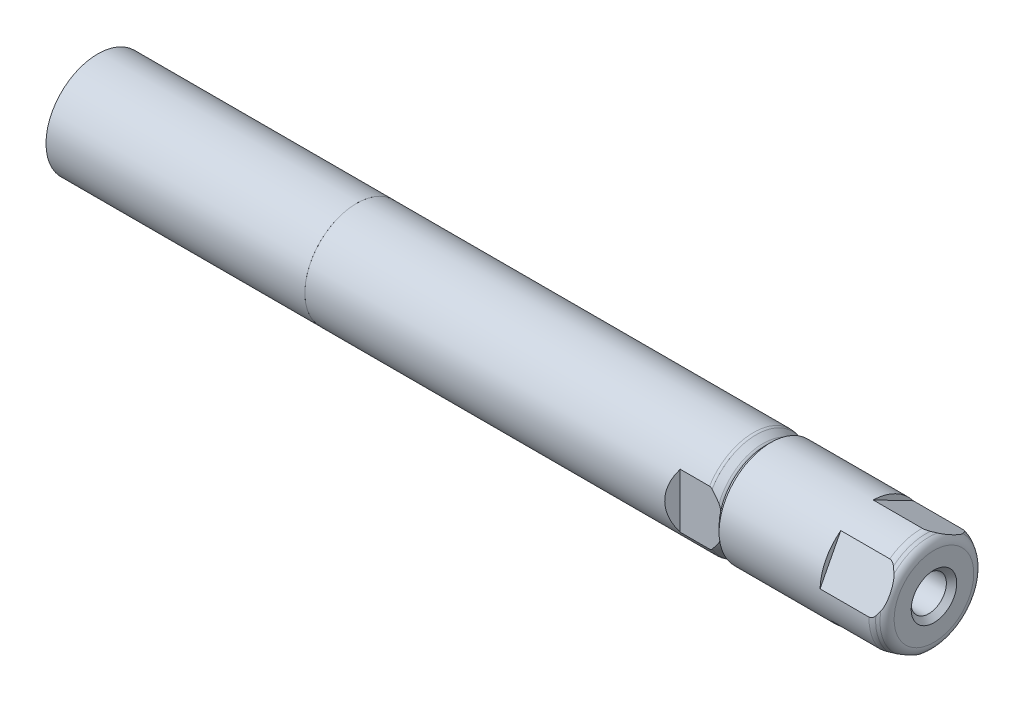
from build123d import *

# Parameters (mm, degrees)
SKETCH_1_R      = 10
EXTRUDE_1_DEPTH = 50


with BuildPart() as part:
    # Sketch 1 → Extrude 1 (new body)
    with BuildSketch(Plane.ZY.offset(203.901062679)):
        with Locations((0, 8.08321256)):
            Circle(SKETCH_1_R)
    extrude(amount=EXTRUDE_1_DEPTH)


solid = part.part
